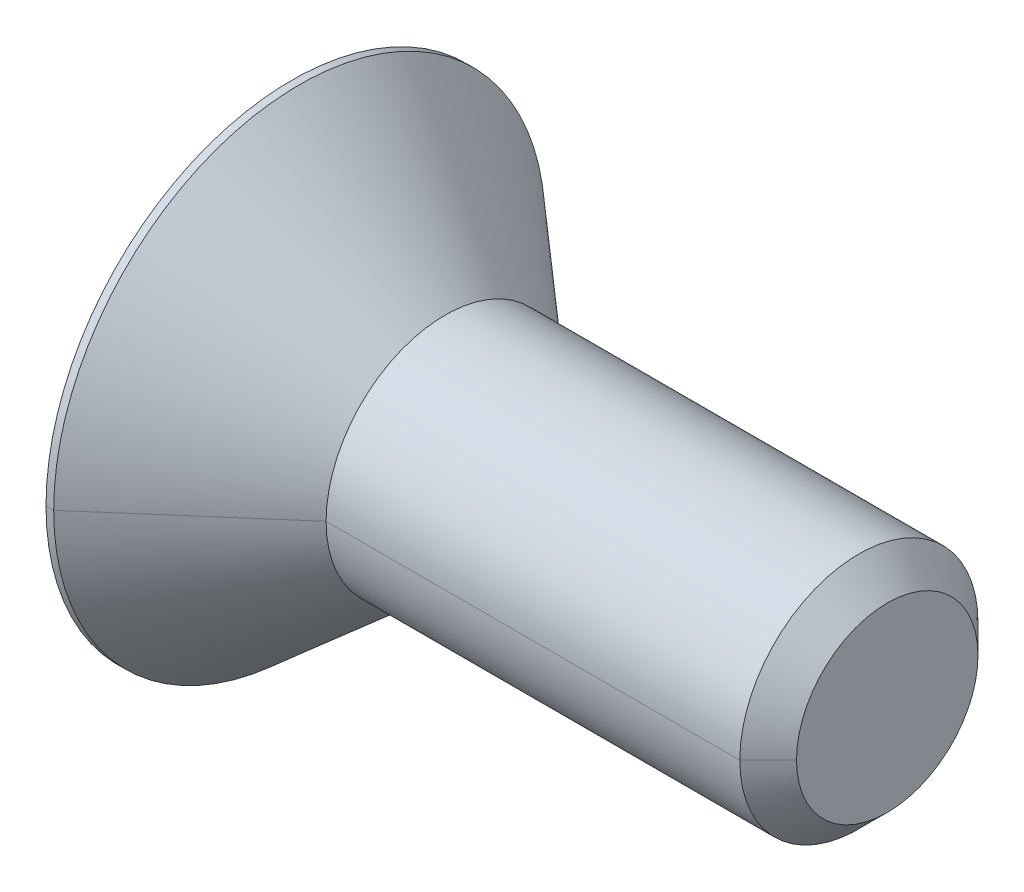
ISO-10303-21;
HEADER;
FILE_DESCRIPTION(('STEP AP214'),'2;1');
FILE_NAME('part.step','',(''),(''),'','','');
FILE_SCHEMA(('AUTOMOTIVE_DESIGN { 1 0 10303 214 1 1 1 1 }'));
ENDSEC;
DATA;
#1=APPLICATION_CONTEXT('core data for automotive mechanical design processes');
#2=APPLICATION_PROTOCOL_DEFINITION('international standard','automotive_design',2000,#1);
#3=PRODUCT_CONTEXT('',#1,'mechanical');
#4=PRODUCT('Part','Part','',(#3));
#5=PRODUCT_RELATED_PRODUCT_CATEGORY('part','',(#4));
#6=PRODUCT_DEFINITION_FORMATION('','',#4);
#7=PRODUCT_DEFINITION_CONTEXT('part definition',#1,'design');
#8=PRODUCT_DEFINITION('design','',#6,#7);
#9=PRODUCT_DEFINITION_SHAPE('','',#8);
#10=(LENGTH_UNIT() NAMED_UNIT(*) SI_UNIT(.MILLI.,.METRE.));
#11=(NAMED_UNIT(*) PLANE_ANGLE_UNIT() SI_UNIT($,.RADIAN.));
#12=(NAMED_UNIT(*) SI_UNIT($,.STERADIAN.) SOLID_ANGLE_UNIT());
#13=UNCERTAINTY_MEASURE_WITH_UNIT(LENGTH_MEASURE(1.E-05),#10,'distance_accuracy_value','');
#14=(GEOMETRIC_REPRESENTATION_CONTEXT(3) GLOBAL_UNCERTAINTY_ASSIGNED_CONTEXT((#13)) GLOBAL_UNIT_ASSIGNED_CONTEXT((#10,
#11,#12)) REPRESENTATION_CONTEXT('',''));
#15=CARTESIAN_POINT('',(0.,0.,0.));
#16=DIRECTION('',(0.,0.,1.));
#17=DIRECTION('',(1.,0.,0.));
#18=AXIS2_PLACEMENT_3D('',#15,#16,#17);
#19=CARTESIAN_POINT('',(11.7856,0.,0.));
#20=DIRECTION('',(-1.,0.,0.));
#21=DIRECTION('',(0.,-1.,0.));
#22=AXIS2_PLACEMENT_3D('',#19,#20,#21);
#23=CYLINDRICAL_SURFACE('',#22,6.5521181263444);
#24=CARTESIAN_POINT('',(-3.88493,0.,0.));
#25=DIRECTION('',(1.,0.,0.));
#26=DIRECTION('',(0.,0.,-1.));
#27=AXIS2_PLACEMENT_3D('',#24,#25,#26);
#28=CIRCLE('',#27,6.5521181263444);
#29=CARTESIAN_POINT('',(-3.88493,0.,-6.5521181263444));
#30=VERTEX_POINT('',#29);
#31=CARTESIAN_POINT('',(-3.88493,0.,6.5521181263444));
#32=VERTEX_POINT('',#31);
#33=EDGE_CURVE('E11',#30,#32,#28,.T.);
#34=ORIENTED_EDGE('',*,*,#33,.F.);
#35=CARTESIAN_POINT('',(-3.88493,0.,-6.5521181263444));
#36=DIRECTION('',(-1.,0.,0.));
#37=VECTOR('',#36,1.);
#38=LINE('',#35,#37);
#39=CARTESIAN_POINT('',(-4.0894,0.,-6.5521181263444));
#40=VERTEX_POINT('',#39);
#41=EDGE_CURVE('E26',#30,#40,#38,.T.);
#42=ORIENTED_EDGE('',*,*,#41,.T.);
#43=CARTESIAN_POINT('',(-4.0894,0.,0.));
#44=DIRECTION('',(1.,0.,0.));
#45=DIRECTION('',(0.,0.,-1.));
#46=AXIS2_PLACEMENT_3D('',#43,#44,#45);
#47=CIRCLE('',#46,6.5521181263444);
#48=CARTESIAN_POINT('',(-4.0894,0.,6.5521181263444));
#49=VERTEX_POINT('',#48);
#50=EDGE_CURVE('E421',#40,#49,#47,.T.);
#51=ORIENTED_EDGE('',*,*,#50,.T.);
#52=CARTESIAN_POINT('',(-3.88493,0.,6.5521181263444));
#53=DIRECTION('',(-1.,0.,0.));
#54=VECTOR('',#53,1.);
#55=LINE('',#52,#54);
#56=EDGE_CURVE('E408',#32,#49,#55,.T.);
#57=ORIENTED_EDGE('',*,*,#56,.F.);
#58=EDGE_LOOP('',(#34,#42,#51,#57));
#59=FACE_BOUND('',#58,.T.);
#60=ADVANCED_FACE('F17',(#59),#23,.T.);
#61=CARTESIAN_POINT('',(11.7856,0.,0.));
#62=DIRECTION('',(-1.,0.,0.));
#63=DIRECTION('',(0.,1.,0.));
#64=AXIS2_PLACEMENT_3D('',#61,#62,#63);
#65=CYLINDRICAL_SURFACE('',#64,6.5521181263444);
#66=CARTESIAN_POINT('',(-4.0894,0.,0.));
#67=DIRECTION('',(1.,0.,0.));
#68=DIRECTION('',(0.,0.,-1.));
#69=AXIS2_PLACEMENT_3D('',#66,#67,#68);
#70=CIRCLE('',#69,6.5521181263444);
#71=EDGE_CURVE('E406',#49,#40,#70,.T.);
#72=ORIENTED_EDGE('',*,*,#71,.T.);
#73=ORIENTED_EDGE('',*,*,#41,.F.);
#74=CARTESIAN_POINT('',(-3.88493,0.,0.));
#75=DIRECTION('',(1.,0.,0.));
#76=DIRECTION('',(0.,0.,-1.));
#77=AXIS2_PLACEMENT_3D('',#74,#75,#76);
#78=CIRCLE('',#77,6.5521181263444);
#79=EDGE_CURVE('E409',#32,#30,#78,.T.);
#80=ORIENTED_EDGE('',*,*,#79,.F.);
#81=ORIENTED_EDGE('',*,*,#56,.T.);
#82=EDGE_LOOP('',(#72,#73,#80,#81));
#83=FACE_BOUND('',#82,.T.);
#84=ADVANCED_FACE('F383',(#83),#65,.T.);
#85=CARTESIAN_POINT('',(-3.88493,0.,0.));
#86=DIRECTION('',(-1.,0.,0.));
#87=DIRECTION('',(0.,1.,0.));
#88=AXIS2_PLACEMENT_3D('',#85,#86,#87);
#89=CONICAL_SURFACE('',#88,6.5521181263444,0.715584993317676);
#90=ORIENTED_EDGE('',*,*,#79,.T.);
#91=CARTESIAN_POINT('',(0.,0.,-3.175));
#92=DIRECTION('',(-0.754709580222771,0.,-0.656059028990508));
#93=VECTOR('',#92,1.);
#94=LINE('',#91,#93);
#95=CARTESIAN_POINT('',(0.,0.,-3.175));
#96=VERTEX_POINT('',#95);
#97=EDGE_CURVE('E348',#96,#30,#94,.T.);
#98=ORIENTED_EDGE('',*,*,#97,.F.);
#99=CARTESIAN_POINT('',(0.,0.,0.));
#100=DIRECTION('',(1.,0.,0.));
#101=DIRECTION('',(0.,0.,-1.));
#102=AXIS2_PLACEMENT_3D('',#99,#100,#101);
#103=CIRCLE('',#102,3.175);
#104=CARTESIAN_POINT('',(0.,0.,3.175));
#105=VERTEX_POINT('',#104);
#106=EDGE_CURVE('E365',#105,#96,#103,.T.);
#107=ORIENTED_EDGE('',*,*,#106,.F.);
#108=CARTESIAN_POINT('',(0.,0.,3.175));
#109=DIRECTION('',(-0.754709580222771,0.,0.656059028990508));
#110=VECTOR('',#109,1.);
#111=LINE('',#108,#110);
#112=EDGE_CURVE('E350',#105,#32,#111,.T.);
#113=ORIENTED_EDGE('',*,*,#112,.T.);
#114=EDGE_LOOP('',(#90,#98,#107,#113));
#115=FACE_BOUND('',#114,.T.);
#116=ADVANCED_FACE('F333',(#115),#89,.T.);
#117=CARTESIAN_POINT('',(-3.88493,0.,0.));
#118=DIRECTION('',(-1.,0.,0.));
#119=DIRECTION('',(0.,-1.,0.));
#120=AXIS2_PLACEMENT_3D('',#117,#118,#119);
#121=CONICAL_SURFACE('',#120,6.5521181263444,0.715584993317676);
#122=CARTESIAN_POINT('',(0.,0.,0.));
#123=DIRECTION('',(1.,0.,0.));
#124=DIRECTION('',(0.,0.,-1.));
#125=AXIS2_PLACEMENT_3D('',#122,#123,#124);
#126=CIRCLE('',#125,3.175);
#127=EDGE_CURVE('E316',#96,#105,#126,.T.);
#128=ORIENTED_EDGE('',*,*,#127,.F.);
#129=ORIENTED_EDGE('',*,*,#97,.T.);
#130=ORIENTED_EDGE('',*,*,#33,.T.);
#131=ORIENTED_EDGE('',*,*,#112,.F.);
#132=EDGE_LOOP('',(#128,#129,#130,#131));
#133=FACE_BOUND('',#132,.T.);
#134=ADVANCED_FACE('F324',(#133),#121,.T.);
#135=CARTESIAN_POINT('',(11.7856,0.,0.));
#136=DIRECTION('',(-1.,0.,0.));
#137=DIRECTION('',(0.,-1.,0.));
#138=AXIS2_PLACEMENT_3D('',#135,#136,#137);
#139=CYLINDRICAL_SURFACE('',#138,3.175);
#140=CARTESIAN_POINT('',(11.02995,0.,0.));
#141=DIRECTION('',(1.,0.,0.));
#142=DIRECTION('',(0.,0.,-1.));
#143=AXIS2_PLACEMENT_3D('',#140,#141,#142);
#144=CIRCLE('',#143,3.175);
#145=CARTESIAN_POINT('',(11.02995,0.,-3.175));
#146=VERTEX_POINT('',#145);
#147=CARTESIAN_POINT('',(11.02995,0.,3.175));
#148=VERTEX_POINT('',#147);
#149=EDGE_CURVE('E314',#146,#148,#144,.T.);
#150=ORIENTED_EDGE('',*,*,#149,.F.);
#151=CARTESIAN_POINT('',(11.02995,0.,-3.175));
#152=DIRECTION('',(-1.,0.,0.));
#153=VECTOR('',#152,1.);
#154=LINE('',#151,#153);
#155=EDGE_CURVE('E292',#146,#96,#154,.T.);
#156=ORIENTED_EDGE('',*,*,#155,.T.);
#157=ORIENTED_EDGE('',*,*,#127,.T.);
#158=CARTESIAN_POINT('',(11.02995,0.,3.175));
#159=DIRECTION('',(-1.,0.,0.));
#160=VECTOR('',#159,1.);
#161=LINE('',#158,#160);
#162=EDGE_CURVE('E304',#148,#105,#161,.T.);
#163=ORIENTED_EDGE('',*,*,#162,.F.);
#164=EDGE_LOOP('',(#150,#156,#157,#163));
#165=FACE_BOUND('',#164,.T.);
#166=ADVANCED_FACE('F271',(#165),#139,.T.);
#167=CARTESIAN_POINT('',(11.7856,0.,0.));
#168=DIRECTION('',(-1.,0.,0.));
#169=DIRECTION('',(0.,1.,0.));
#170=AXIS2_PLACEMENT_3D('',#167,#168,#169);
#171=CYLINDRICAL_SURFACE('',#170,3.175);
#172=ORIENTED_EDGE('',*,*,#106,.T.);
#173=ORIENTED_EDGE('',*,*,#155,.F.);
#174=CARTESIAN_POINT('',(11.02995,0.,0.));
#175=DIRECTION('',(1.,0.,0.));
#176=DIRECTION('',(0.,0.,-1.));
#177=AXIS2_PLACEMENT_3D('',#174,#175,#176);
#178=CIRCLE('',#177,3.175);
#179=EDGE_CURVE('E620',#148,#146,#178,.T.);
#180=ORIENTED_EDGE('',*,*,#179,.F.);
#181=ORIENTED_EDGE('',*,*,#162,.T.);
#182=EDGE_LOOP('',(#172,#173,#180,#181));
#183=FACE_BOUND('',#182,.T.);
#184=ADVANCED_FACE('F262',(#183),#171,.T.);
#185=CARTESIAN_POINT('',(11.02995,0.,0.));
#186=DIRECTION('',(-1.,0.,0.));
#187=DIRECTION('',(0.,1.,0.));
#188=AXIS2_PLACEMENT_3D('',#185,#186,#187);
#189=CONICAL_SURFACE('',#188,3.175,0.785398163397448);
#190=ORIENTED_EDGE('',*,*,#179,.T.);
#191=CARTESIAN_POINT('',(11.7856,0.,-2.41935));
#192=DIRECTION('',(-0.707106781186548,0.,-0.707106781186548));
#193=VECTOR('',#192,1.);
#194=LINE('',#191,#193);
#195=CARTESIAN_POINT('',(11.7856,0.,-2.41935));
#196=VERTEX_POINT('',#195);
#197=EDGE_CURVE('E225',#196,#146,#194,.T.);
#198=ORIENTED_EDGE('',*,*,#197,.F.);
#199=CARTESIAN_POINT('',(11.7856,0.,0.));
#200=DIRECTION('',(1.,0.,0.));
#201=DIRECTION('',(0.,0.,-1.));
#202=AXIS2_PLACEMENT_3D('',#199,#200,#201);
#203=CIRCLE('',#202,2.41935);
#204=CARTESIAN_POINT('',(11.7856,0.,2.41935));
#205=VERTEX_POINT('',#204);
#206=EDGE_CURVE('E243',#205,#196,#203,.T.);
#207=ORIENTED_EDGE('',*,*,#206,.F.);
#208=CARTESIAN_POINT('',(11.7856,0.,2.41935));
#209=DIRECTION('',(-0.707106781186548,0.,0.707106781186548));
#210=VECTOR('',#209,1.);
#211=LINE('',#208,#210);
#212=EDGE_CURVE('E228',#205,#148,#211,.T.);
#213=ORIENTED_EDGE('',*,*,#212,.T.);
#214=EDGE_LOOP('',(#190,#198,#207,#213));
#215=FACE_BOUND('',#214,.T.);
#216=ADVANCED_FACE('F207',(#215),#189,.T.);
#217=CARTESIAN_POINT('',(11.02995,0.,0.));
#218=DIRECTION('',(-1.,0.,0.));
#219=DIRECTION('',(0.,-1.,0.));
#220=AXIS2_PLACEMENT_3D('',#217,#218,#219);
#221=CONICAL_SURFACE('',#220,3.175,0.785398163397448);
#222=CARTESIAN_POINT('',(11.7856,0.,0.));
#223=DIRECTION('',(1.,0.,0.));
#224=DIRECTION('',(0.,0.,-1.));
#225=AXIS2_PLACEMENT_3D('',#222,#223,#224);
#226=CIRCLE('',#225,2.41935);
#227=EDGE_CURVE('E187',#196,#205,#226,.T.);
#228=ORIENTED_EDGE('',*,*,#227,.F.);
#229=ORIENTED_EDGE('',*,*,#197,.T.);
#230=ORIENTED_EDGE('',*,*,#149,.T.);
#231=ORIENTED_EDGE('',*,*,#212,.F.);
#232=EDGE_LOOP('',(#228,#229,#230,#231));
#233=FACE_BOUND('',#232,.T.);
#234=ADVANCED_FACE('F196',(#233),#221,.T.);
#235=CARTESIAN_POINT('',(11.7856,2.41935,0.));
#236=DIRECTION('',(-1.,0.,0.));
#237=DIRECTION('',(0.,0.,1.));
#238=AXIS2_PLACEMENT_3D('',#235,#236,#237);
#239=PLANE('',#238);
#240=ORIENTED_EDGE('',*,*,#227,.T.);
#241=ORIENTED_EDGE('',*,*,#206,.T.);
#242=EDGE_LOOP('',(#240,#241));
#243=FACE_BOUND('',#242,.T.);
#244=ADVANCED_FACE('F206',(#243),#239,.F.);
#245=CARTESIAN_POINT('',(-4.0894,0.,0.));
#246=DIRECTION('',(1.,0.,0.));
#247=DIRECTION('',(0.,0.,-1.));
#248=AXIS2_PLACEMENT_3D('',#245,#246,#247);
#249=PLANE('',#248);
#250=ORIENTED_EDGE('',*,*,#50,.F.);
#251=ORIENTED_EDGE('',*,*,#71,.F.);
#252=EDGE_LOOP('',(#250,#251));
#253=FACE_BOUND('',#252,.T.);
#254=DIRECTION('',(0.,-1.,0.));
#255=VECTOR('',#254,1.);
#256=CARTESIAN_POINT('',(-4.0894,1.1438463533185,1.9812));
#257=LINE('',#256,#255);
#258=CARTESIAN_POINT('',(-4.0894,1.1438463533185,1.9812));
#259=VERTEX_POINT('',#258);
#260=CARTESIAN_POINT('',(-4.0894,-1.1438463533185,1.9812));
#261=VERTEX_POINT('',#260);
#262=EDGE_CURVE('E183',#259,#261,#257,.T.);
#263=ORIENTED_EDGE('',*,*,#262,.T.);
#264=DIRECTION('',(0.,-0.500000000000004,-0.866025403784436));
#265=VECTOR('',#264,1.);
#266=CARTESIAN_POINT('',(-4.0894,-1.1438463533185,1.9812));
#267=LINE('',#266,#265);
#268=CARTESIAN_POINT('',(-4.0894,-2.287692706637,0.));
#269=VERTEX_POINT('',#268);
#270=EDGE_CURVE('E179',#261,#269,#267,.T.);
#271=ORIENTED_EDGE('',*,*,#270,.T.);
#272=DIRECTION('',(0.,0.500000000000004,-0.866025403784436));
#273=VECTOR('',#272,1.);
#274=CARTESIAN_POINT('',(-4.0894,-2.287692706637,0.));
#275=LINE('',#274,#273);
#276=CARTESIAN_POINT('',(-4.0894,-1.1438463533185,-1.9812));
#277=VERTEX_POINT('',#276);
#278=EDGE_CURVE('E175',#269,#277,#275,.T.);
#279=ORIENTED_EDGE('',*,*,#278,.T.);
#280=DIRECTION('',(0.,1.,0.));
#281=VECTOR('',#280,1.);
#282=CARTESIAN_POINT('',(-4.0894,-1.1438463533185,-1.9812));
#283=LINE('',#282,#281);
#284=CARTESIAN_POINT('',(-4.0894,1.1438463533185,-1.9812));
#285=VERTEX_POINT('',#284);
#286=EDGE_CURVE('E171',#277,#285,#283,.T.);
#287=ORIENTED_EDGE('',*,*,#286,.T.);
#288=DIRECTION('',(0.,0.500000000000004,0.866025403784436));
#289=VECTOR('',#288,1.);
#290=CARTESIAN_POINT('',(-4.0894,1.1438463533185,-1.9812));
#291=LINE('',#290,#289);
#292=CARTESIAN_POINT('',(-4.0894,2.287692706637,0.));
#293=VERTEX_POINT('',#292);
#294=EDGE_CURVE('E116',#285,#293,#291,.T.);
#295=ORIENTED_EDGE('',*,*,#294,.T.);
#296=DIRECTION('',(0.,-0.500000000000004,0.866025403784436));
#297=VECTOR('',#296,1.);
#298=CARTESIAN_POINT('',(-4.0894,2.287692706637,0.));
#299=LINE('',#298,#297);
#300=EDGE_CURVE('E164',#293,#259,#299,.T.);
#301=ORIENTED_EDGE('',*,*,#300,.T.);
#302=EDGE_LOOP('',(#263,#271,#279,#287,#295,#301));
#303=FACE_BOUND('',#302,.T.);
#304=ADVANCED_FACE('F435',(#253,#303),#249,.F.);
#305=CARTESIAN_POINT('',(-1.27,2.287692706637,0.));
#306=DIRECTION('',(0.,-0.866025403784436,-0.500000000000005));
#307=DIRECTION('',(0.,0.500000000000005,-0.866025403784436));
#308=AXIS2_PLACEMENT_3D('',#305,#306,#307);
#309=PLANE('',#308);
#310=ORIENTED_EDGE('',*,*,#300,.F.);
#311=DIRECTION('',(-1.,0.,0.));
#312=VECTOR('',#311,1.);
#313=CARTESIAN_POINT('',(-1.27,2.287692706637,0.));
#314=LINE('',#313,#312);
#315=CARTESIAN_POINT('',(-1.27,2.287692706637,0.));
#316=VERTEX_POINT('',#315);
#317=EDGE_CURVE('E160',#316,#293,#314,.T.);
#318=ORIENTED_EDGE('',*,*,#317,.F.);
#319=DIRECTION('',(0.,-0.500000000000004,0.866025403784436));
#320=VECTOR('',#319,1.);
#321=CARTESIAN_POINT('',(-1.27,2.287692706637,0.));
#322=LINE('',#321,#320);
#323=CARTESIAN_POINT('',(-1.27,1.1438463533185,1.9812));
#324=VERTEX_POINT('',#323);
#325=EDGE_CURVE('E120',#316,#324,#322,.T.);
#326=ORIENTED_EDGE('',*,*,#325,.T.);
#327=DIRECTION('',(-1.,0.,0.));
#328=VECTOR('',#327,1.);
#329=CARTESIAN_POINT('',(-1.27,1.1438463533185,1.9812));
#330=LINE('',#329,#328);
#331=EDGE_CURVE('E152',#324,#259,#330,.T.);
#332=ORIENTED_EDGE('',*,*,#331,.T.);
#333=EDGE_LOOP('',(#310,#318,#326,#332));
#334=FACE_BOUND('',#333,.T.);
#335=ADVANCED_FACE('F438',(#334),#309,.T.);
#336=CARTESIAN_POINT('',(-1.27,1.1438463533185,1.9812));
#337=DIRECTION('',(0.,0.,-1.));
#338=DIRECTION('',(-1.,0.,0.));
#339=AXIS2_PLACEMENT_3D('',#336,#337,#338);
#340=PLANE('',#339);
#341=ORIENTED_EDGE('',*,*,#262,.F.);
#342=ORIENTED_EDGE('',*,*,#331,.F.);
#343=DIRECTION('',(0.,-1.,0.));
#344=VECTOR('',#343,1.);
#345=CARTESIAN_POINT('',(-1.27,1.1438463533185,1.9812));
#346=LINE('',#345,#344);
#347=CARTESIAN_POINT('',(-1.27,-1.1438463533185,1.9812));
#348=VERTEX_POINT('',#347);
#349=EDGE_CURVE('E148',#324,#348,#346,.T.);
#350=ORIENTED_EDGE('',*,*,#349,.T.);
#351=DIRECTION('',(-1.,0.,0.));
#352=VECTOR('',#351,1.);
#353=CARTESIAN_POINT('',(-1.27,-1.1438463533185,1.9812));
#354=LINE('',#353,#352);
#355=EDGE_CURVE('E143',#348,#261,#354,.T.);
#356=ORIENTED_EDGE('',*,*,#355,.T.);
#357=EDGE_LOOP('',(#341,#342,#350,#356));
#358=FACE_BOUND('',#357,.T.);
#359=ADVANCED_FACE('F445',(#358),#340,.T.);
#360=CARTESIAN_POINT('',(-1.27,-1.1438463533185,1.9812));
#361=DIRECTION('',(0.,0.866025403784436,-0.500000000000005));
#362=DIRECTION('',(0.,0.500000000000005,0.866025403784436));
#363=AXIS2_PLACEMENT_3D('',#360,#361,#362);
#364=PLANE('',#363);
#365=ORIENTED_EDGE('',*,*,#270,.F.);
#366=ORIENTED_EDGE('',*,*,#355,.F.);
#367=DIRECTION('',(0.,-0.500000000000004,-0.866025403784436));
#368=VECTOR('',#367,1.);
#369=CARTESIAN_POINT('',(-1.27,-1.1438463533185,1.9812));
#370=LINE('',#369,#368);
#371=CARTESIAN_POINT('',(-1.27,-2.287692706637,0.));
#372=VERTEX_POINT('',#371);
#373=EDGE_CURVE('E139',#348,#372,#370,.T.);
#374=ORIENTED_EDGE('',*,*,#373,.T.);
#375=DIRECTION('',(-1.,0.,0.));
#376=VECTOR('',#375,1.);
#377=CARTESIAN_POINT('',(-1.27,-2.287692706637,0.));
#378=LINE('',#377,#376);
#379=EDGE_CURVE('E134',#372,#269,#378,.T.);
#380=ORIENTED_EDGE('',*,*,#379,.T.);
#381=EDGE_LOOP('',(#365,#366,#374,#380));
#382=FACE_BOUND('',#381,.T.);
#383=ADVANCED_FACE('F448',(#382),#364,.T.);
#384=CARTESIAN_POINT('',(-1.27,-2.287692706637,0.));
#385=DIRECTION('',(0.,0.866025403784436,0.500000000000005));
#386=DIRECTION('',(0.,-0.500000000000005,0.866025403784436));
#387=AXIS2_PLACEMENT_3D('',#384,#385,#386);
#388=PLANE('',#387);
#389=ORIENTED_EDGE('',*,*,#278,.F.);
#390=ORIENTED_EDGE('',*,*,#379,.F.);
#391=DIRECTION('',(0.,0.500000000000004,-0.866025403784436));
#392=VECTOR('',#391,1.);
#393=CARTESIAN_POINT('',(-1.27,-2.287692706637,0.));
#394=LINE('',#393,#392);
#395=CARTESIAN_POINT('',(-1.27,-1.1438463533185,-1.9812));
#396=VERTEX_POINT('',#395);
#397=EDGE_CURVE('E130',#372,#396,#394,.T.);
#398=ORIENTED_EDGE('',*,*,#397,.T.);
#399=DIRECTION('',(-1.,0.,0.));
#400=VECTOR('',#399,1.);
#401=CARTESIAN_POINT('',(-1.27,-1.1438463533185,-1.9812));
#402=LINE('',#401,#400);
#403=EDGE_CURVE('E105',#396,#277,#402,.T.);
#404=ORIENTED_EDGE('',*,*,#403,.T.);
#405=EDGE_LOOP('',(#389,#390,#398,#404));
#406=FACE_BOUND('',#405,.T.);
#407=ADVANCED_FACE('F452',(#406),#388,.T.);
#408=CARTESIAN_POINT('',(-1.27,-1.1438463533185,-1.9812));
#409=DIRECTION('',(0.,0.,1.));
#410=DIRECTION('',(1.,0.,0.));
#411=AXIS2_PLACEMENT_3D('',#408,#409,#410);
#412=PLANE('',#411);
#413=ORIENTED_EDGE('',*,*,#286,.F.);
#414=ORIENTED_EDGE('',*,*,#403,.F.);
#415=DIRECTION('',(0.,1.,0.));
#416=VECTOR('',#415,1.);
#417=CARTESIAN_POINT('',(-1.27,-1.1438463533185,-1.9812));
#418=LINE('',#417,#416);
#419=CARTESIAN_POINT('',(-1.27,1.1438463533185,-1.9812));
#420=VERTEX_POINT('',#419);
#421=EDGE_CURVE('E98',#396,#420,#418,.T.);
#422=ORIENTED_EDGE('',*,*,#421,.T.);
#423=DIRECTION('',(-1.,0.,0.));
#424=VECTOR('',#423,1.);
#425=CARTESIAN_POINT('',(-1.27,1.1438463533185,-1.9812));
#426=LINE('',#425,#424);
#427=EDGE_CURVE('E102',#420,#285,#426,.T.);
#428=ORIENTED_EDGE('',*,*,#427,.T.);
#429=EDGE_LOOP('',(#413,#414,#422,#428));
#430=FACE_BOUND('',#429,.T.);
#431=ADVANCED_FACE('F101',(#430),#412,.T.);
#432=CARTESIAN_POINT('',(-1.27,1.1438463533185,-1.9812));
#433=DIRECTION('',(0.,-0.866025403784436,0.500000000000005));
#434=DIRECTION('',(0.,-0.500000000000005,-0.866025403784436));
#435=AXIS2_PLACEMENT_3D('',#432,#433,#434);
#436=PLANE('',#435);
#437=ORIENTED_EDGE('',*,*,#294,.F.);
#438=ORIENTED_EDGE('',*,*,#427,.F.);
#439=DIRECTION('',(0.,0.500000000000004,0.866025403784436));
#440=VECTOR('',#439,1.);
#441=CARTESIAN_POINT('',(-1.27,1.1438463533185,-1.9812));
#442=LINE('',#441,#440);
#443=EDGE_CURVE('E114',#420,#316,#442,.T.);
#444=ORIENTED_EDGE('',*,*,#443,.T.);
#445=ORIENTED_EDGE('',*,*,#317,.T.);
#446=EDGE_LOOP('',(#437,#438,#444,#445));
#447=FACE_BOUND('',#446,.T.);
#448=ADVANCED_FACE('F112',(#447),#436,.T.);
#449=CARTESIAN_POINT('',(-1.27,0.,0.));
#450=DIRECTION('',(1.,0.,0.));
#451=DIRECTION('',(0.,0.,-1.));
#452=AXIS2_PLACEMENT_3D('',#449,#450,#451);
#453=PLANE('',#452);
#454=ORIENTED_EDGE('',*,*,#349,.F.);
#455=ORIENTED_EDGE('',*,*,#325,.F.);
#456=ORIENTED_EDGE('',*,*,#443,.F.);
#457=ORIENTED_EDGE('',*,*,#421,.F.);
#458=ORIENTED_EDGE('',*,*,#397,.F.);
#459=ORIENTED_EDGE('',*,*,#373,.F.);
#460=EDGE_LOOP('',(#454,#455,#456,#457,#458,#459));
#461=FACE_BOUND('',#460,.T.);
#462=ADVANCED_FACE('F119',(#461),#453,.F.);
#463=CLOSED_SHELL('',(#60,#84,#116,#134,#166,#184,#216,#234,#244,#304,#335,#359,#383,#407,#431,
#448,#462));
#464=MANIFOLD_SOLID_BREP('B1',#463);
#465=ADVANCED_BREP_SHAPE_REPRESENTATION('',(#18,#464),#14);
#466=SHAPE_DEFINITION_REPRESENTATION(#9,#465);
ENDSEC;
END-ISO-10303-21;
